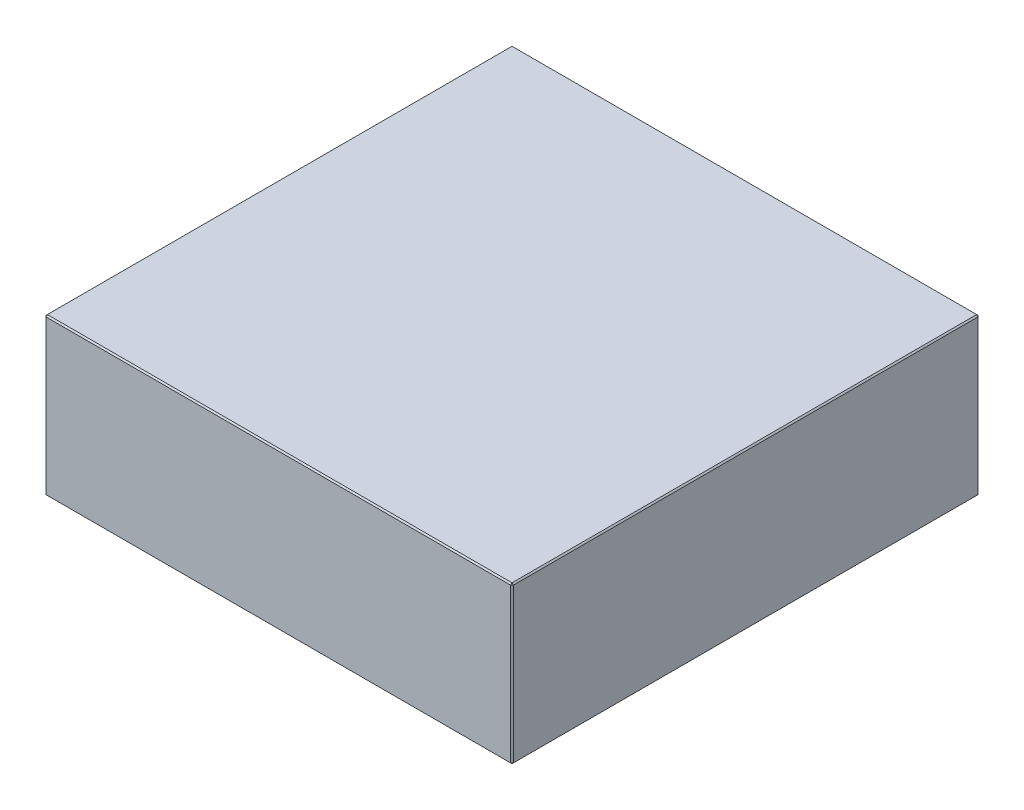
ISO-10303-21;
HEADER;
FILE_DESCRIPTION(('STEP AP214'),'2;1');
FILE_NAME('part.step','',(''),(''),'','','');
FILE_SCHEMA(('AUTOMOTIVE_DESIGN { 1 0 10303 214 1 1 1 1 }'));
ENDSEC;
DATA;
#1=APPLICATION_CONTEXT('core data for automotive mechanical design processes');
#2=APPLICATION_PROTOCOL_DEFINITION('international standard','automotive_design',2000,#1);
#3=PRODUCT_CONTEXT('',#1,'mechanical');
#4=PRODUCT('Part','Part','',(#3));
#5=PRODUCT_RELATED_PRODUCT_CATEGORY('part','',(#4));
#6=PRODUCT_DEFINITION_FORMATION('','',#4);
#7=PRODUCT_DEFINITION_CONTEXT('part definition',#1,'design');
#8=PRODUCT_DEFINITION('design','',#6,#7);
#9=PRODUCT_DEFINITION_SHAPE('','',#8);
#10=(LENGTH_UNIT() NAMED_UNIT(*) SI_UNIT(.MILLI.,.METRE.));
#11=(NAMED_UNIT(*) PLANE_ANGLE_UNIT() SI_UNIT($,.RADIAN.));
#12=(NAMED_UNIT(*) SI_UNIT($,.STERADIAN.) SOLID_ANGLE_UNIT());
#13=UNCERTAINTY_MEASURE_WITH_UNIT(LENGTH_MEASURE(1.E-05),#10,'distance_accuracy_value','');
#14=(GEOMETRIC_REPRESENTATION_CONTEXT(3) GLOBAL_UNCERTAINTY_ASSIGNED_CONTEXT((#13)) GLOBAL_UNIT_ASSIGNED_CONTEXT((#10,
#11,#12)) REPRESENTATION_CONTEXT('',''));
#15=CARTESIAN_POINT('',(0.,0.,0.));
#16=DIRECTION('',(0.,0.,1.));
#17=DIRECTION('',(1.,0.,0.));
#18=AXIS2_PLACEMENT_3D('',#15,#16,#17);
#19=CARTESIAN_POINT('',(-173.,116.,173.));
#20=DIRECTION('',(1.,0.,0.));
#21=DIRECTION('',(0.,0.,-1.));
#22=AXIS2_PLACEMENT_3D('',#19,#20,#21);
#23=PLANE('',#22);
#24=DIRECTION('',(0.,-1.,0.));
#25=VECTOR('',#24,1.);
#26=CARTESIAN_POINT('',(-173.,116.,-172.));
#27=LINE('',#26,#25);
#28=CARTESIAN_POINT('',(-173.,115.,-172.));
#29=VERTEX_POINT('',#28);
#30=CARTESIAN_POINT('',(-173.,1.,-172.));
#31=VERTEX_POINT('',#30);
#32=EDGE_CURVE('E114',#29,#31,#27,.T.);
#33=ORIENTED_EDGE('',*,*,#32,.T.);
#34=DIRECTION('',(0.,0.,1.));
#35=VECTOR('',#34,1.);
#36=CARTESIAN_POINT('',(-173.,1.,173.));
#37=LINE('',#36,#35);
#38=CARTESIAN_POINT('',(-173.,1.,172.));
#39=VERTEX_POINT('',#38);
#40=EDGE_CURVE('E110',#31,#39,#37,.T.);
#41=ORIENTED_EDGE('',*,*,#40,.T.);
#42=DIRECTION('',(0.,1.,0.));
#43=VECTOR('',#42,1.);
#44=CARTESIAN_POINT('',(-173.,116.,172.));
#45=LINE('',#44,#43);
#46=CARTESIAN_POINT('',(-173.,115.,172.));
#47=VERTEX_POINT('',#46);
#48=EDGE_CURVE('E103',#39,#47,#45,.T.);
#49=ORIENTED_EDGE('',*,*,#48,.T.);
#50=DIRECTION('',(0.,0.,-1.));
#51=VECTOR('',#50,1.);
#52=CARTESIAN_POINT('',(-173.,115.,-173.));
#53=LINE('',#52,#51);
#54=EDGE_CURVE('E107',#47,#29,#53,.T.);
#55=ORIENTED_EDGE('',*,*,#54,.T.);
#56=EDGE_LOOP('',(#33,#41,#49,#55));
#57=FACE_BOUND('',#56,.T.);
#58=ADVANCED_FACE('F15',(#57),#23,.F.);
#59=CARTESIAN_POINT('',(173.,116.,173.));
#60=DIRECTION('',(0.,0.,-1.));
#61=DIRECTION('',(-1.,0.,0.));
#62=AXIS2_PLACEMENT_3D('',#59,#60,#61);
#63=PLANE('',#62);
#64=DIRECTION('',(-1.,0.,0.));
#65=VECTOR('',#64,1.);
#66=CARTESIAN_POINT('',(-173.,115.,173.));
#67=LINE('',#66,#65);
#68=CARTESIAN_POINT('',(172.,115.,173.));
#69=VERTEX_POINT('',#68);
#70=CARTESIAN_POINT('',(-172.,115.,173.));
#71=VERTEX_POINT('',#70);
#72=EDGE_CURVE('E164',#69,#71,#67,.T.);
#73=ORIENTED_EDGE('',*,*,#72,.T.);
#74=DIRECTION('',(0.,-1.,0.));
#75=VECTOR('',#74,1.);
#76=CARTESIAN_POINT('',(-172.,116.,173.));
#77=LINE('',#76,#75);
#78=CARTESIAN_POINT('',(-172.,1.,173.));
#79=VERTEX_POINT('',#78);
#80=EDGE_CURVE('E122',#71,#79,#77,.T.);
#81=ORIENTED_EDGE('',*,*,#80,.T.);
#82=DIRECTION('',(1.,0.,0.));
#83=VECTOR('',#82,1.);
#84=CARTESIAN_POINT('',(173.,1.,173.));
#85=LINE('',#84,#83);
#86=CARTESIAN_POINT('',(172.,1.,173.));
#87=VERTEX_POINT('',#86);
#88=EDGE_CURVE('E168',#79,#87,#85,.T.);
#89=ORIENTED_EDGE('',*,*,#88,.T.);
#90=DIRECTION('',(0.,1.,0.));
#91=VECTOR('',#90,1.);
#92=CARTESIAN_POINT('',(172.,116.,173.));
#93=LINE('',#92,#91);
#94=EDGE_CURVE('E166',#87,#69,#93,.T.);
#95=ORIENTED_EDGE('',*,*,#94,.T.);
#96=EDGE_LOOP('',(#73,#81,#89,#95));
#97=FACE_BOUND('',#96,.T.);
#98=ADVANCED_FACE('F275',(#97),#63,.F.);
#99=CARTESIAN_POINT('',(173.,116.,173.));
#100=DIRECTION('',(-1.,0.,0.));
#101=DIRECTION('',(0.,0.,1.));
#102=AXIS2_PLACEMENT_3D('',#99,#100,#101);
#103=PLANE('',#102);
#104=DIRECTION('',(0.,0.,-1.));
#105=VECTOR('',#104,1.);
#106=CARTESIAN_POINT('',(173.,1.,173.));
#107=LINE('',#106,#105);
#108=CARTESIAN_POINT('',(173.,1.,172.));
#109=VERTEX_POINT('',#108);
#110=CARTESIAN_POINT('',(173.,1.,-172.));
#111=VERTEX_POINT('',#110);
#112=EDGE_CURVE('E159',#109,#111,#107,.T.);
#113=ORIENTED_EDGE('',*,*,#112,.T.);
#114=DIRECTION('',(0.,1.,0.));
#115=VECTOR('',#114,1.);
#116=CARTESIAN_POINT('',(173.,116.,-172.));
#117=LINE('',#116,#115);
#118=CARTESIAN_POINT('',(173.,115.,-172.));
#119=VERTEX_POINT('',#118);
#120=EDGE_CURVE('E161',#111,#119,#117,.T.);
#121=ORIENTED_EDGE('',*,*,#120,.T.);
#122=DIRECTION('',(0.,0.,1.));
#123=VECTOR('',#122,1.);
#124=CARTESIAN_POINT('',(173.,115.,173.));
#125=LINE('',#124,#123);
#126=CARTESIAN_POINT('',(173.,115.,172.));
#127=VERTEX_POINT('',#126);
#128=EDGE_CURVE('E155',#119,#127,#125,.T.);
#129=ORIENTED_EDGE('',*,*,#128,.T.);
#130=DIRECTION('',(0.,-1.,0.));
#131=VECTOR('',#130,1.);
#132=CARTESIAN_POINT('',(173.,116.,172.));
#133=LINE('',#132,#131);
#134=EDGE_CURVE('E157',#127,#109,#133,.T.);
#135=ORIENTED_EDGE('',*,*,#134,.T.);
#136=EDGE_LOOP('',(#113,#121,#129,#135));
#137=FACE_BOUND('',#136,.T.);
#138=ADVANCED_FACE('F254',(#137),#103,.F.);
#139=CARTESIAN_POINT('',(173.,116.,-173.));
#140=DIRECTION('',(0.,0.,1.));
#141=DIRECTION('',(1.,0.,0.));
#142=AXIS2_PLACEMENT_3D('',#139,#140,#141);
#143=PLANE('',#142);
#144=DIRECTION('',(0.,-1.,0.));
#145=VECTOR('',#144,1.);
#146=CARTESIAN_POINT('',(172.,116.,-173.));
#147=LINE('',#146,#145);
#148=CARTESIAN_POINT('',(172.,115.,-173.));
#149=VERTEX_POINT('',#148);
#150=CARTESIAN_POINT('',(172.,1.,-173.));
#151=VERTEX_POINT('',#150);
#152=EDGE_CURVE('E148',#149,#151,#147,.T.);
#153=ORIENTED_EDGE('',*,*,#152,.T.);
#154=DIRECTION('',(-1.,0.,0.));
#155=VECTOR('',#154,1.);
#156=CARTESIAN_POINT('',(173.,1.,-173.));
#157=LINE('',#156,#155);
#158=CARTESIAN_POINT('',(-172.,1.,-173.));
#159=VERTEX_POINT('',#158);
#160=EDGE_CURVE('E153',#151,#159,#157,.T.);
#161=ORIENTED_EDGE('',*,*,#160,.T.);
#162=DIRECTION('',(0.,1.,0.));
#163=VECTOR('',#162,1.);
#164=CARTESIAN_POINT('',(-172.,116.,-173.));
#165=LINE('',#164,#163);
#166=CARTESIAN_POINT('',(-172.,115.,-173.));
#167=VERTEX_POINT('',#166);
#168=EDGE_CURVE('E150',#159,#167,#165,.T.);
#169=ORIENTED_EDGE('',*,*,#168,.T.);
#170=DIRECTION('',(1.,0.,0.));
#171=VECTOR('',#170,1.);
#172=CARTESIAN_POINT('',(173.,115.,-173.));
#173=LINE('',#172,#171);
#174=EDGE_CURVE('E146',#167,#149,#173,.T.);
#175=ORIENTED_EDGE('',*,*,#174,.T.);
#176=EDGE_LOOP('',(#153,#161,#169,#175));
#177=FACE_BOUND('',#176,.T.);
#178=ADVANCED_FACE('F284',(#177),#143,.F.);
#179=CARTESIAN_POINT('',(0.,116.,0.));
#180=DIRECTION('',(0.,1.,0.));
#181=DIRECTION('',(0.,0.,1.));
#182=AXIS2_PLACEMENT_3D('',#179,#180,#181);
#183=PLANE('',#182);
#184=DIRECTION('',(0.,0.,-1.));
#185=VECTOR('',#184,1.);
#186=CARTESIAN_POINT('',(172.,116.,-173.));
#187=LINE('',#186,#185);
#188=CARTESIAN_POINT('',(172.,116.,172.));
#189=VERTEX_POINT('',#188);
#190=CARTESIAN_POINT('',(172.,116.,-172.));
#191=VERTEX_POINT('',#190);
#192=EDGE_CURVE('E24',#189,#191,#187,.T.);
#193=ORIENTED_EDGE('',*,*,#192,.T.);
#194=DIRECTION('',(-1.,0.,0.));
#195=VECTOR('',#194,1.);
#196=CARTESIAN_POINT('',(-173.,116.,-172.));
#197=LINE('',#196,#195);
#198=CARTESIAN_POINT('',(-172.,116.,-172.));
#199=VERTEX_POINT('',#198);
#200=EDGE_CURVE('E9',#191,#199,#197,.T.);
#201=ORIENTED_EDGE('',*,*,#200,.T.);
#202=DIRECTION('',(0.,0.,1.));
#203=VECTOR('',#202,1.);
#204=CARTESIAN_POINT('',(-172.,116.,173.));
#205=LINE('',#204,#203);
#206=CARTESIAN_POINT('',(-172.,116.,172.));
#207=VERTEX_POINT('',#206);
#208=EDGE_CURVE('E180',#199,#207,#205,.T.);
#209=ORIENTED_EDGE('',*,*,#208,.T.);
#210=DIRECTION('',(1.,0.,0.));
#211=VECTOR('',#210,1.);
#212=CARTESIAN_POINT('',(173.,116.,172.));
#213=LINE('',#212,#211);
#214=EDGE_CURVE('E35',#207,#189,#213,.T.);
#215=ORIENTED_EDGE('',*,*,#214,.T.);
#216=EDGE_LOOP('',(#193,#201,#209,#215));
#217=FACE_BOUND('',#216,.T.);
#218=ADVANCED_FACE('F350',(#217),#183,.T.);
#219=CARTESIAN_POINT('',(0.,0.,0.));
#220=DIRECTION('',(0.,1.,0.));
#221=DIRECTION('',(0.,0.,1.));
#222=AXIS2_PLACEMENT_3D('',#219,#220,#221);
#223=PLANE('',#222);
#224=DIRECTION('',(0.,0.,1.));
#225=VECTOR('',#224,1.);
#226=CARTESIAN_POINT('',(172.,0.,0.));
#227=LINE('',#226,#225);
#228=CARTESIAN_POINT('',(172.,0.,-172.));
#229=VERTEX_POINT('',#228);
#230=CARTESIAN_POINT('',(172.,0.,172.));
#231=VERTEX_POINT('',#230);
#232=EDGE_CURVE('E171',#229,#231,#227,.T.);
#233=ORIENTED_EDGE('',*,*,#232,.T.);
#234=DIRECTION('',(-1.,0.,0.));
#235=VECTOR('',#234,1.);
#236=CARTESIAN_POINT('',(0.,0.,172.));
#237=LINE('',#236,#235);
#238=CARTESIAN_POINT('',(-172.,0.,172.));
#239=VERTEX_POINT('',#238);
#240=EDGE_CURVE('E177',#231,#239,#237,.T.);
#241=ORIENTED_EDGE('',*,*,#240,.T.);
#242=DIRECTION('',(0.,0.,-1.));
#243=VECTOR('',#242,1.);
#244=CARTESIAN_POINT('',(-172.,0.,0.));
#245=LINE('',#244,#243);
#246=CARTESIAN_POINT('',(-172.,0.,-172.));
#247=VERTEX_POINT('',#246);
#248=EDGE_CURVE('E175',#239,#247,#245,.T.);
#249=ORIENTED_EDGE('',*,*,#248,.T.);
#250=DIRECTION('',(1.,0.,0.));
#251=VECTOR('',#250,1.);
#252=CARTESIAN_POINT('',(0.,0.,-172.));
#253=LINE('',#252,#251);
#254=EDGE_CURVE('E173',#247,#229,#253,.T.);
#255=ORIENTED_EDGE('',*,*,#254,.T.);
#256=EDGE_LOOP('',(#233,#241,#249,#255));
#257=FACE_BOUND('',#256,.T.);
#258=ADVANCED_FACE('F246',(#257),#223,.F.);
#259=CARTESIAN_POINT('',(173.,116.,172.));
#260=DIRECTION('',(-0.707106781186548,0.,-0.707106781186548));
#261=DIRECTION('',(0.,-1.,0.));
#262=AXIS2_PLACEMENT_3D('',#259,#260,#261);
#263=PLANE('',#262);
#264=DIRECTION('',(-0.707106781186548,0.,0.707106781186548));
#265=VECTOR('',#264,1.);
#266=CARTESIAN_POINT('',(172.,115.,173.));
#267=LINE('',#266,#265);
#268=EDGE_CURVE('E19',#69,#127,#267,.F.);
#269=ORIENTED_EDGE('',*,*,#268,.F.);
#270=ORIENTED_EDGE('',*,*,#94,.F.);
#271=DIRECTION('',(0.707106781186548,0.,-0.707106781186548));
#272=VECTOR('',#271,1.);
#273=CARTESIAN_POINT('',(172.,1.,173.));
#274=LINE('',#273,#272);
#275=EDGE_CURVE('E142',#109,#87,#274,.F.);
#276=ORIENTED_EDGE('',*,*,#275,.F.);
#277=ORIENTED_EDGE('',*,*,#134,.F.);
#278=EDGE_LOOP('',(#269,#270,#276,#277));
#279=FACE_BOUND('',#278,.T.);
#280=ADVANCED_FACE('F17',(#279),#263,.F.);
#281=CARTESIAN_POINT('',(172.,115.,173.));
#282=DIRECTION('',(0.577350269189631,0.577350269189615,0.577350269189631));
#283=DIRECTION('',(0.707106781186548,0.,-0.707106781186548));
#284=AXIS2_PLACEMENT_3D('',#281,#282,#283);
#285=PLANE('',#284);
#286=DIRECTION('',(0.,-0.707106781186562,0.707106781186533));
#287=VECTOR('',#286,1.);
#288=CARTESIAN_POINT('',(172.,115.,173.));
#289=LINE('',#288,#287);
#290=EDGE_CURVE('E226',#69,#189,#289,.F.);
#291=ORIENTED_EDGE('',*,*,#290,.F.);
#292=ORIENTED_EDGE('',*,*,#268,.T.);
#293=DIRECTION('',(-0.707106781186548,0.707106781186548,0.));
#294=VECTOR('',#293,1.);
#295=CARTESIAN_POINT('',(172.5,115.5,172.));
#296=LINE('',#295,#294);
#297=EDGE_CURVE('E228',#189,#127,#296,.F.);
#298=ORIENTED_EDGE('',*,*,#297,.F.);
#299=EDGE_LOOP('',(#291,#292,#298));
#300=FACE_BOUND('',#299,.T.);
#301=ADVANCED_FACE('F270',(#300),#285,.T.);
#302=CARTESIAN_POINT('',(172.,1.,173.));
#303=DIRECTION('',(0.577350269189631,-0.577350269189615,0.577350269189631));
#304=DIRECTION('',(0.707106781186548,0.,-0.707106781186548));
#305=AXIS2_PLACEMENT_3D('',#302,#303,#304);
#306=PLANE('',#305);
#307=DIRECTION('',(-0.707106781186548,-0.707106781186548,0.));
#308=VECTOR('',#307,1.);
#309=CARTESIAN_POINT('',(172.5,0.499999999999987,172.));
#310=LINE('',#309,#308);
#311=EDGE_CURVE('E220',#109,#231,#310,.T.);
#312=ORIENTED_EDGE('',*,*,#311,.F.);
#313=ORIENTED_EDGE('',*,*,#275,.T.);
#314=DIRECTION('',(0.,0.707106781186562,0.707106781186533));
#315=VECTOR('',#314,1.);
#316=CARTESIAN_POINT('',(172.,1.,173.));
#317=LINE('',#316,#315);
#318=EDGE_CURVE('E223',#231,#87,#317,.T.);
#319=ORIENTED_EDGE('',*,*,#318,.F.);
#320=EDGE_LOOP('',(#312,#313,#319));
#321=FACE_BOUND('',#320,.T.);
#322=ADVANCED_FACE('F235',(#321),#306,.T.);
#323=CARTESIAN_POINT('',(172.,116.,0.));
#324=DIRECTION('',(0.707106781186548,0.707106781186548,0.));
#325=DIRECTION('',(0.,0.,1.));
#326=AXIS2_PLACEMENT_3D('',#323,#324,#325);
#327=PLANE('',#326);
#328=ORIENTED_EDGE('',*,*,#297,.T.);
#329=ORIENTED_EDGE('',*,*,#128,.F.);
#330=DIRECTION('',(0.707106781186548,-0.707106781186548,0.));
#331=VECTOR('',#330,1.);
#332=CARTESIAN_POINT('',(173.,115.,-172.));
#333=LINE('',#332,#331);
#334=EDGE_CURVE('E215',#191,#119,#333,.T.);
#335=ORIENTED_EDGE('',*,*,#334,.F.);
#336=ORIENTED_EDGE('',*,*,#192,.F.);
#337=EDGE_LOOP('',(#328,#329,#335,#336));
#338=FACE_BOUND('',#337,.T.);
#339=ADVANCED_FACE('F265',(#338),#327,.T.);
#340=CARTESIAN_POINT('',(0.,116.,172.));
#341=DIRECTION('',(0.,0.707106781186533,0.707106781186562));
#342=DIRECTION('',(-1.,0.,0.));
#343=AXIS2_PLACEMENT_3D('',#340,#341,#342);
#344=PLANE('',#343);
#345=ORIENTED_EDGE('',*,*,#290,.T.);
#346=ORIENTED_EDGE('',*,*,#214,.F.);
#347=DIRECTION('',(0.,0.707106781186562,-0.707106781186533));
#348=VECTOR('',#347,1.);
#349=CARTESIAN_POINT('',(-172.,115.5,172.5));
#350=LINE('',#349,#348);
#351=EDGE_CURVE('E126',#71,#207,#350,.T.);
#352=ORIENTED_EDGE('',*,*,#351,.F.);
#353=ORIENTED_EDGE('',*,*,#72,.F.);
#354=EDGE_LOOP('',(#345,#346,#352,#353));
#355=FACE_BOUND('',#354,.T.);
#356=ADVANCED_FACE('F273',(#355),#344,.T.);
#357=CARTESIAN_POINT('',(-172.,116.,173.));
#358=DIRECTION('',(0.707106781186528,0.,-0.707106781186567));
#359=DIRECTION('',(0.,-1.,0.));
#360=AXIS2_PLACEMENT_3D('',#357,#358,#359);
#361=PLANE('',#360);
#362=DIRECTION('',(0.707106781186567,0.,0.707106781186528));
#363=VECTOR('',#362,1.);
#364=CARTESIAN_POINT('',(-172.,1.,173.));
#365=LINE('',#364,#363);
#366=EDGE_CURVE('E127',#79,#39,#365,.F.);
#367=ORIENTED_EDGE('',*,*,#366,.F.);
#368=ORIENTED_EDGE('',*,*,#80,.F.);
#369=DIRECTION('',(-0.707106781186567,0.,-0.707106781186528));
#370=VECTOR('',#369,1.);
#371=CARTESIAN_POINT('',(-173.,115.,172.));
#372=LINE('',#371,#370);
#373=EDGE_CURVE('E118',#47,#71,#372,.F.);
#374=ORIENTED_EDGE('',*,*,#373,.F.);
#375=ORIENTED_EDGE('',*,*,#48,.F.);
#376=EDGE_LOOP('',(#367,#368,#374,#375));
#377=FACE_BOUND('',#376,.T.);
#378=ADVANCED_FACE('F120',(#377),#361,.F.);
#379=CARTESIAN_POINT('',(173.,1.,173.));
#380=DIRECTION('',(0.,0.707106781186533,-0.707106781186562));
#381=DIRECTION('',(1.,0.,0.));
#382=AXIS2_PLACEMENT_3D('',#379,#380,#381);
#383=PLANE('',#382);
#384=ORIENTED_EDGE('',*,*,#318,.T.);
#385=ORIENTED_EDGE('',*,*,#88,.F.);
#386=DIRECTION('',(0.,-0.707106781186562,-0.707106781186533));
#387=VECTOR('',#386,1.);
#388=CARTESIAN_POINT('',(-172.,1.,173.));
#389=LINE('',#388,#387);
#390=EDGE_CURVE('E211',#239,#79,#389,.F.);
#391=ORIENTED_EDGE('',*,*,#390,.F.);
#392=ORIENTED_EDGE('',*,*,#240,.F.);
#393=EDGE_LOOP('',(#384,#385,#391,#392));
#394=FACE_BOUND('',#393,.T.);
#395=ADVANCED_FACE('F243',(#394),#383,.F.);
#396=CARTESIAN_POINT('',(173.,1.,173.));
#397=DIRECTION('',(-0.707106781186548,0.707106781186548,0.));
#398=DIRECTION('',(0.,0.,-1.));
#399=AXIS2_PLACEMENT_3D('',#396,#397,#398);
#400=PLANE('',#399);
#401=ORIENTED_EDGE('',*,*,#311,.T.);
#402=ORIENTED_EDGE('',*,*,#232,.F.);
#403=DIRECTION('',(0.707106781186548,0.707106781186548,0.));
#404=VECTOR('',#403,1.);
#405=CARTESIAN_POINT('',(172.5,0.499999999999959,-172.));
#406=LINE('',#405,#404);
#407=EDGE_CURVE('E208',#111,#229,#406,.F.);
#408=ORIENTED_EDGE('',*,*,#407,.F.);
#409=ORIENTED_EDGE('',*,*,#112,.F.);
#410=EDGE_LOOP('',(#401,#402,#408,#409));
#411=FACE_BOUND('',#410,.T.);
#412=ADVANCED_FACE('F251',(#411),#400,.F.);
#413=CARTESIAN_POINT('',(172.,116.,-173.));
#414=DIRECTION('',(-0.707106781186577,0.,0.707106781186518));
#415=DIRECTION('',(0.,-1.,0.));
#416=AXIS2_PLACEMENT_3D('',#413,#414,#415);
#417=PLANE('',#416);
#418=DIRECTION('',(0.707106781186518,0.,0.707106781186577));
#419=VECTOR('',#418,1.);
#420=CARTESIAN_POINT('',(173.,115.,-172.));
#421=LINE('',#420,#419);
#422=EDGE_CURVE('E217',#119,#149,#421,.F.);
#423=ORIENTED_EDGE('',*,*,#422,.F.);
#424=ORIENTED_EDGE('',*,*,#120,.F.);
#425=DIRECTION('',(-0.707106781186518,0.,-0.707106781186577));
#426=VECTOR('',#425,1.);
#427=CARTESIAN_POINT('',(172.,1.,-173.));
#428=LINE('',#427,#426);
#429=EDGE_CURVE('E205',#151,#111,#428,.F.);
#430=ORIENTED_EDGE('',*,*,#429,.F.);
#431=ORIENTED_EDGE('',*,*,#152,.F.);
#432=EDGE_LOOP('',(#423,#424,#430,#431));
#433=FACE_BOUND('',#432,.T.);
#434=ADVANCED_FACE('F258',(#433),#417,.F.);
#435=CARTESIAN_POINT('',(173.,115.,-172.));
#436=DIRECTION('',(0.577350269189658,0.57735026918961,-0.57735026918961));
#437=DIRECTION('',(-0.707106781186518,0.,-0.707106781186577));
#438=AXIS2_PLACEMENT_3D('',#435,#436,#437);
#439=PLANE('',#438);
#440=ORIENTED_EDGE('',*,*,#334,.T.);
#441=ORIENTED_EDGE('',*,*,#422,.T.);
#442=DIRECTION('',(0.,0.707106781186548,0.707106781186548));
#443=VECTOR('',#442,1.);
#444=CARTESIAN_POINT('',(172.,115.5,-172.5));
#445=LINE('',#444,#443);
#446=EDGE_CURVE('E134',#191,#149,#445,.F.);
#447=ORIENTED_EDGE('',*,*,#446,.F.);
#448=EDGE_LOOP('',(#440,#441,#447));
#449=FACE_BOUND('',#448,.T.);
#450=ADVANCED_FACE('F325',(#449),#439,.T.);
#451=CARTESIAN_POINT('',(-173.,115.,172.));
#452=DIRECTION('',(-0.577350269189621,0.577350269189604,0.577350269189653));
#453=DIRECTION('',(0.707106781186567,0.,0.707106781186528));
#454=AXIS2_PLACEMENT_3D('',#451,#452,#453);
#455=PLANE('',#454);
#456=ORIENTED_EDGE('',*,*,#373,.T.);
#457=ORIENTED_EDGE('',*,*,#351,.T.);
#458=DIRECTION('',(-0.707106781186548,-0.707106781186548,0.));
#459=VECTOR('',#458,1.);
#460=CARTESIAN_POINT('',(-173.,115.,172.));
#461=LINE('',#460,#459);
#462=EDGE_CURVE('E130',#47,#207,#461,.F.);
#463=ORIENTED_EDGE('',*,*,#462,.F.);
#464=EDGE_LOOP('',(#456,#457,#463));
#465=FACE_BOUND('',#464,.T.);
#466=ADVANCED_FACE('F131',(#465),#455,.T.);
#467=CARTESIAN_POINT('',(-172.,1.,173.));
#468=DIRECTION('',(-0.577350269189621,-0.577350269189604,0.577350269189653));
#469=DIRECTION('',(0.707106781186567,0.,0.707106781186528));
#470=AXIS2_PLACEMENT_3D('',#467,#468,#469);
#471=PLANE('',#470);
#472=ORIENTED_EDGE('',*,*,#390,.T.);
#473=ORIENTED_EDGE('',*,*,#366,.T.);
#474=DIRECTION('',(-0.707106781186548,0.707106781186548,0.));
#475=VECTOR('',#474,1.);
#476=CARTESIAN_POINT('',(-172.5,0.499999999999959,172.));
#477=LINE('',#476,#475);
#478=EDGE_CURVE('E135',#239,#39,#477,.T.);
#479=ORIENTED_EDGE('',*,*,#478,.F.);
#480=EDGE_LOOP('',(#472,#473,#479));
#481=FACE_BOUND('',#480,.T.);
#482=ADVANCED_FACE('F318',(#481),#471,.T.);
#483=CARTESIAN_POINT('',(172.,1.,-173.));
#484=DIRECTION('',(0.577350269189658,-0.57735026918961,-0.57735026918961));
#485=DIRECTION('',(-0.707106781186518,0.,-0.707106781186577));
#486=AXIS2_PLACEMENT_3D('',#483,#484,#485);
#487=PLANE('',#486);
#488=ORIENTED_EDGE('',*,*,#429,.T.);
#489=ORIENTED_EDGE('',*,*,#407,.T.);
#490=DIRECTION('',(0.,-0.707106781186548,0.707106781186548));
#491=VECTOR('',#490,1.);
#492=CARTESIAN_POINT('',(172.,1.,-173.));
#493=LINE('',#492,#491);
#494=EDGE_CURVE('E198',#151,#229,#493,.T.);
#495=ORIENTED_EDGE('',*,*,#494,.F.);
#496=EDGE_LOOP('',(#488,#489,#495));
#497=FACE_BOUND('',#496,.T.);
#498=ADVANCED_FACE('F314',(#497),#487,.T.);
#499=CARTESIAN_POINT('',(0.,116.,-172.));
#500=DIRECTION('',(0.,0.707106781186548,-0.707106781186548));
#501=DIRECTION('',(1.,0.,0.));
#502=AXIS2_PLACEMENT_3D('',#499,#500,#501);
#503=PLANE('',#502);
#504=ORIENTED_EDGE('',*,*,#446,.T.);
#505=ORIENTED_EDGE('',*,*,#174,.F.);
#506=DIRECTION('',(0.,-0.707106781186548,-0.707106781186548));
#507=VECTOR('',#506,1.);
#508=CARTESIAN_POINT('',(-172.,115.,-173.));
#509=LINE('',#508,#507);
#510=EDGE_CURVE('E195',#199,#167,#509,.T.);
#511=ORIENTED_EDGE('',*,*,#510,.F.);
#512=ORIENTED_EDGE('',*,*,#200,.F.);
#513=EDGE_LOOP('',(#504,#505,#511,#512));
#514=FACE_BOUND('',#513,.T.);
#515=ADVANCED_FACE('F311',(#514),#503,.T.);
#516=CARTESIAN_POINT('',(-172.,116.,0.));
#517=DIRECTION('',(-0.707106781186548,0.707106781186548,0.));
#518=DIRECTION('',(0.,0.,-1.));
#519=AXIS2_PLACEMENT_3D('',#516,#517,#518);
#520=PLANE('',#519);
#521=ORIENTED_EDGE('',*,*,#462,.T.);
#522=ORIENTED_EDGE('',*,*,#208,.F.);
#523=DIRECTION('',(0.707106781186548,0.707106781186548,0.));
#524=VECTOR('',#523,1.);
#525=CARTESIAN_POINT('',(-172.5,115.5,-172.));
#526=LINE('',#525,#524);
#527=EDGE_CURVE('E138',#29,#199,#526,.T.);
#528=ORIENTED_EDGE('',*,*,#527,.F.);
#529=ORIENTED_EDGE('',*,*,#54,.F.);
#530=EDGE_LOOP('',(#521,#522,#528,#529));
#531=FACE_BOUND('',#530,.T.);
#532=ADVANCED_FACE('F137',(#531),#520,.T.);
#533=CARTESIAN_POINT('',(-173.,1.,173.));
#534=DIRECTION('',(0.707106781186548,0.707106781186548,0.));
#535=DIRECTION('',(0.,0.,1.));
#536=AXIS2_PLACEMENT_3D('',#533,#534,#535);
#537=PLANE('',#536);
#538=ORIENTED_EDGE('',*,*,#478,.T.);
#539=ORIENTED_EDGE('',*,*,#40,.F.);
#540=DIRECTION('',(0.707106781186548,-0.707106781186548,0.));
#541=VECTOR('',#540,1.);
#542=CARTESIAN_POINT('',(-173.,1.,-172.));
#543=LINE('',#542,#541);
#544=EDGE_CURVE('E191',#247,#31,#543,.F.);
#545=ORIENTED_EDGE('',*,*,#544,.F.);
#546=ORIENTED_EDGE('',*,*,#248,.F.);
#547=EDGE_LOOP('',(#538,#539,#545,#546));
#548=FACE_BOUND('',#547,.T.);
#549=ADVANCED_FACE('F304',(#548),#537,.F.);
#550=CARTESIAN_POINT('',(173.,1.,-173.));
#551=DIRECTION('',(0.,0.707106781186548,0.707106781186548));
#552=DIRECTION('',(-1.,0.,0.));
#553=AXIS2_PLACEMENT_3D('',#550,#551,#552);
#554=PLANE('',#553);
#555=ORIENTED_EDGE('',*,*,#494,.T.);
#556=ORIENTED_EDGE('',*,*,#254,.F.);
#557=DIRECTION('',(0.,0.707106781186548,-0.707106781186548));
#558=VECTOR('',#557,1.);
#559=CARTESIAN_POINT('',(-172.,0.499999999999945,-172.5));
#560=LINE('',#559,#558);
#561=EDGE_CURVE('E188',#159,#247,#560,.F.);
#562=ORIENTED_EDGE('',*,*,#561,.F.);
#563=ORIENTED_EDGE('',*,*,#160,.F.);
#564=EDGE_LOOP('',(#555,#556,#562,#563));
#565=FACE_BOUND('',#564,.T.);
#566=ADVANCED_FACE('F300',(#565),#554,.F.);
#567=CARTESIAN_POINT('',(-172.,115.,-173.));
#568=DIRECTION('',(-0.577350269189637,0.577350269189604,-0.577350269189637));
#569=DIRECTION('',(-0.707106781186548,0.,0.707106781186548));
#570=AXIS2_PLACEMENT_3D('',#567,#568,#569);
#571=PLANE('',#570);
#572=ORIENTED_EDGE('',*,*,#527,.T.);
#573=ORIENTED_EDGE('',*,*,#510,.T.);
#574=DIRECTION('',(0.707106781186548,0.,-0.707106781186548));
#575=VECTOR('',#574,1.);
#576=CARTESIAN_POINT('',(-172.,115.,-173.));
#577=LINE('',#576,#575);
#578=EDGE_CURVE('E186',#29,#167,#577,.T.);
#579=ORIENTED_EDGE('',*,*,#578,.F.);
#580=EDGE_LOOP('',(#572,#573,#579));
#581=FACE_BOUND('',#580,.T.);
#582=ADVANCED_FACE('F296',(#581),#571,.T.);
#583=CARTESIAN_POINT('',(-173.,1.,-172.));
#584=DIRECTION('',(-0.577350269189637,-0.577350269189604,-0.577350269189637));
#585=DIRECTION('',(-0.707106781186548,0.,0.707106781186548));
#586=AXIS2_PLACEMENT_3D('',#583,#584,#585);
#587=PLANE('',#586);
#588=ORIENTED_EDGE('',*,*,#561,.T.);
#589=ORIENTED_EDGE('',*,*,#544,.T.);
#590=DIRECTION('',(-0.707106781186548,0.,0.707106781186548));
#591=VECTOR('',#590,1.);
#592=CARTESIAN_POINT('',(-173.,1.,-172.));
#593=LINE('',#592,#591);
#594=EDGE_CURVE('E184',#159,#31,#593,.T.);
#595=ORIENTED_EDGE('',*,*,#594,.F.);
#596=EDGE_LOOP('',(#588,#589,#595));
#597=FACE_BOUND('',#596,.T.);
#598=ADVANCED_FACE('F292',(#597),#587,.T.);
#599=CARTESIAN_POINT('',(-173.,116.,-172.));
#600=DIRECTION('',(0.707106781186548,0.,0.707106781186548));
#601=DIRECTION('',(0.,-1.,0.));
#602=AXIS2_PLACEMENT_3D('',#599,#600,#601);
#603=PLANE('',#602);
#604=ORIENTED_EDGE('',*,*,#578,.T.);
#605=ORIENTED_EDGE('',*,*,#168,.F.);
#606=ORIENTED_EDGE('',*,*,#594,.T.);
#607=ORIENTED_EDGE('',*,*,#32,.F.);
#608=EDGE_LOOP('',(#604,#605,#606,#607));
#609=FACE_BOUND('',#608,.T.);
#610=ADVANCED_FACE('F289',(#609),#603,.F.);
#611=CLOSED_SHELL('',(#58,#98,#138,#178,#218,#258,#280,#301,#322,#339,#356,#378,#395,#412,#434,
#450,#466,#482,#498,#515,#532,#549,#566,#582,#598,#610));
#612=MANIFOLD_SOLID_BREP('B1',#611);
#613=ADVANCED_BREP_SHAPE_REPRESENTATION('',(#18,#612),#14);
#614=SHAPE_DEFINITION_REPRESENTATION(#9,#613);
ENDSEC;
END-ISO-10303-21;
